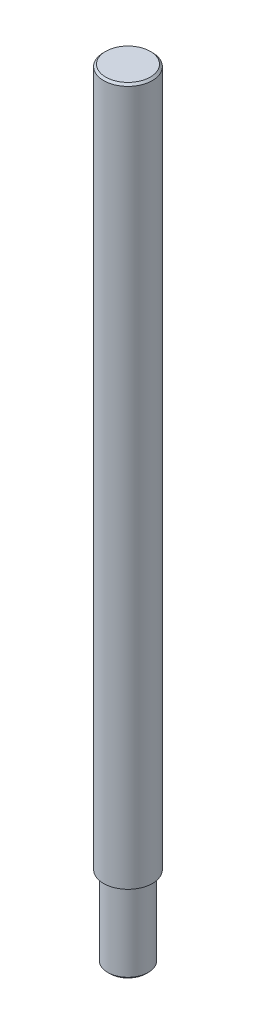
ISO-10303-21;
HEADER;
FILE_DESCRIPTION(('STEP AP214'),'2;1');
FILE_NAME('part.step','',(''),(''),'','','');
FILE_SCHEMA(('AUTOMOTIVE_DESIGN { 1 0 10303 214 1 1 1 1 }'));
ENDSEC;
DATA;
#1=APPLICATION_CONTEXT('core data for automotive mechanical design processes');
#2=APPLICATION_PROTOCOL_DEFINITION('international standard','automotive_design',2000,#1);
#3=PRODUCT_CONTEXT('',#1,'mechanical');
#4=PRODUCT('Part','Part','',(#3));
#5=PRODUCT_RELATED_PRODUCT_CATEGORY('part','',(#4));
#6=PRODUCT_DEFINITION_FORMATION('','',#4);
#7=PRODUCT_DEFINITION_CONTEXT('part definition',#1,'design');
#8=PRODUCT_DEFINITION('design','',#6,#7);
#9=PRODUCT_DEFINITION_SHAPE('','',#8);
#10=(LENGTH_UNIT() NAMED_UNIT(*) SI_UNIT(.MILLI.,.METRE.));
#11=(NAMED_UNIT(*) PLANE_ANGLE_UNIT() SI_UNIT($,.RADIAN.));
#12=(NAMED_UNIT(*) SI_UNIT($,.STERADIAN.) SOLID_ANGLE_UNIT());
#13=UNCERTAINTY_MEASURE_WITH_UNIT(LENGTH_MEASURE(1.E-05),#10,'distance_accuracy_value','');
#14=(GEOMETRIC_REPRESENTATION_CONTEXT(3) GLOBAL_UNCERTAINTY_ASSIGNED_CONTEXT((#13)) GLOBAL_UNIT_ASSIGNED_CONTEXT((#10,
#11,#12)) REPRESENTATION_CONTEXT('',''));
#15=CARTESIAN_POINT('',(0.,0.,0.));
#16=DIRECTION('',(0.,0.,1.));
#17=DIRECTION('',(1.,0.,0.));
#18=AXIS2_PLACEMENT_3D('',#15,#16,#17);
#19=CARTESIAN_POINT('',(0.,-10.,0.));
#20=DIRECTION('',(0.,1.,0.));
#21=DIRECTION('',(0.,0.,1.));
#22=AXIS2_PLACEMENT_3D('',#19,#20,#21);
#23=CYLINDRICAL_SURFACE('',#22,2.5);
#24=CARTESIAN_POINT('',(0.,-9.75,0.));
#25=DIRECTION('',(0.,1.,0.));
#26=DIRECTION('',(0.,0.,1.));
#27=AXIS2_PLACEMENT_3D('',#24,#25,#26);
#28=CIRCLE('',#27,2.5);
#29=CARTESIAN_POINT('',(0.,-9.75,2.5));
#30=VERTEX_POINT('',#29);
#31=EDGE_CURVE('E9178',#30,#30,#28,.T.);
#32=ORIENTED_EDGE('',*,*,#31,.T.);
#33=EDGE_LOOP('',(#32));
#34=FACE_BOUND('',#33,.T.);
#35=CARTESIAN_POINT('',(0.,0.,0.));
#36=DIRECTION('',(0.,1.,0.));
#37=DIRECTION('',(0.,0.,1.));
#38=AXIS2_PLACEMENT_3D('',#35,#36,#37);
#39=CIRCLE('',#38,2.5);
#40=CARTESIAN_POINT('',(0.,0.,2.5));
#41=VERTEX_POINT('',#40);
#42=EDGE_CURVE('E9191',#41,#41,#39,.T.);
#43=ORIENTED_EDGE('',*,*,#42,.F.);
#44=EDGE_LOOP('',(#43));
#45=FACE_BOUND('',#44,.T.);
#46=ADVANCED_FACE('F9172',(#34,#45),#23,.T.);
#47=CARTESIAN_POINT('',(0.,-10.,0.));
#48=DIRECTION('',(0.,1.,0.));
#49=DIRECTION('',(0.,0.,1.));
#50=AXIS2_PLACEMENT_3D('',#47,#48,#49);
#51=PLANE('',#50);
#52=CARTESIAN_POINT('',(0.,-10.,0.));
#53=DIRECTION('',(0.,1.,0.));
#54=DIRECTION('',(0.,0.,1.));
#55=AXIS2_PLACEMENT_3D('',#52,#53,#54);
#56=CIRCLE('',#55,2.25);
#57=CARTESIAN_POINT('',(0.,-10.,2.25));
#58=VERTEX_POINT('',#57);
#59=EDGE_CURVE('E10',#58,#58,#56,.F.);
#60=ORIENTED_EDGE('',*,*,#59,.T.);
#61=EDGE_LOOP('',(#60));
#62=FACE_BOUND('',#61,.T.);
#63=ADVANCED_FACE('F9217',(#62),#51,.F.);
#64=CARTESIAN_POINT('',(0.,86.,0.));
#65=DIRECTION('',(0.,-1.,0.));
#66=DIRECTION('',(0.,0.,-1.));
#67=AXIS2_PLACEMENT_3D('',#64,#65,#66);
#68=CYLINDRICAL_SURFACE('',#67,3.);
#69=CARTESIAN_POINT('',(0.,85.75,0.));
#70=DIRECTION('',(0.,1.,0.));
#71=DIRECTION('',(0.,0.,1.));
#72=AXIS2_PLACEMENT_3D('',#69,#70,#71);
#73=CIRCLE('',#72,3.);
#74=CARTESIAN_POINT('',(0.,85.75,3.));
#75=VERTEX_POINT('',#74);
#76=EDGE_CURVE('E9182',#75,#75,#73,.F.);
#77=ORIENTED_EDGE('',*,*,#76,.T.);
#78=EDGE_LOOP('',(#77));
#79=FACE_BOUND('',#78,.T.);
#80=CARTESIAN_POINT('',(0.,0.,0.));
#81=DIRECTION('',(0.,1.,0.));
#82=DIRECTION('',(0.,0.,1.));
#83=AXIS2_PLACEMENT_3D('',#80,#81,#82);
#84=CIRCLE('',#83,3.);
#85=CARTESIAN_POINT('',(0.,0.,3.));
#86=VERTEX_POINT('',#85);
#87=EDGE_CURVE('E9194',#86,#86,#84,.T.);
#88=ORIENTED_EDGE('',*,*,#87,.T.);
#89=EDGE_LOOP('',(#88));
#90=FACE_BOUND('',#89,.T.);
#91=ADVANCED_FACE('F9198',(#79,#90),#68,.T.);
#92=CARTESIAN_POINT('',(0.,86.,0.));
#93=DIRECTION('',(0.,1.,0.));
#94=DIRECTION('',(0.,0.,1.));
#95=AXIS2_PLACEMENT_3D('',#92,#93,#94);
#96=PLANE('',#95);
#97=CARTESIAN_POINT('',(0.,86.,0.));
#98=DIRECTION('',(0.,1.,0.));
#99=DIRECTION('',(0.,0.,1.));
#100=AXIS2_PLACEMENT_3D('',#97,#98,#99);
#101=CIRCLE('',#100,2.75);
#102=CARTESIAN_POINT('',(0.,86.,2.75));
#103=VERTEX_POINT('',#102);
#104=EDGE_CURVE('E9186',#103,#103,#101,.T.);
#105=ORIENTED_EDGE('',*,*,#104,.T.);
#106=EDGE_LOOP('',(#105));
#107=FACE_BOUND('',#106,.T.);
#108=ADVANCED_FACE('F9203',(#107),#96,.T.);
#109=CARTESIAN_POINT('',(0.,0.,0.));
#110=DIRECTION('',(0.,1.,0.));
#111=DIRECTION('',(0.,0.,1.));
#112=AXIS2_PLACEMENT_3D('',#109,#110,#111);
#113=PLANE('',#112);
#114=ORIENTED_EDGE('',*,*,#42,.T.);
#115=EDGE_LOOP('',(#114));
#116=FACE_BOUND('',#115,.T.);
#117=ORIENTED_EDGE('',*,*,#87,.F.);
#118=EDGE_LOOP('',(#117));
#119=FACE_BOUND('',#118,.T.);
#120=ADVANCED_FACE('F9200',(#116,#119),#113,.F.);
#121=CARTESIAN_POINT('',(0.,86.,0.));
#122=DIRECTION('',(0.,-1.,0.));
#123=DIRECTION('',(0.,0.,-1.));
#124=AXIS2_PLACEMENT_3D('',#121,#122,#123);
#125=CONICAL_SURFACE('',#124,2.75,0.785398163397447);
#126=ORIENTED_EDGE('',*,*,#76,.F.);
#127=EDGE_LOOP('',(#126));
#128=FACE_BOUND('',#127,.T.);
#129=ORIENTED_EDGE('',*,*,#104,.F.);
#130=EDGE_LOOP('',(#129));
#131=FACE_BOUND('',#130,.T.);
#132=ADVANCED_FACE('F9202',(#128,#131),#125,.T.);
#133=CARTESIAN_POINT('',(0.,-9.75,0.));
#134=DIRECTION('',(0.,1.,0.));
#135=DIRECTION('',(0.,0.,1.));
#136=AXIS2_PLACEMENT_3D('',#133,#134,#135);
#137=CONICAL_SURFACE('',#136,2.5,0.785398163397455);
#138=ORIENTED_EDGE('',*,*,#59,.F.);
#139=EDGE_LOOP('',(#138));
#140=FACE_BOUND('',#139,.T.);
#141=ORIENTED_EDGE('',*,*,#31,.F.);
#142=EDGE_LOOP('',(#141));
#143=FACE_BOUND('',#142,.T.);
#144=ADVANCED_FACE('F9210',(#140,#143),#137,.T.);
#145=CLOSED_SHELL('',(#46,#63,#91,#108,#120,#132,#144));
#146=MANIFOLD_SOLID_BREP('B2',#145);
#147=ADVANCED_BREP_SHAPE_REPRESENTATION('',(#18,#146),#14);
#148=SHAPE_DEFINITION_REPRESENTATION(#9,#147);
ENDSEC;
END-ISO-10303-21;
